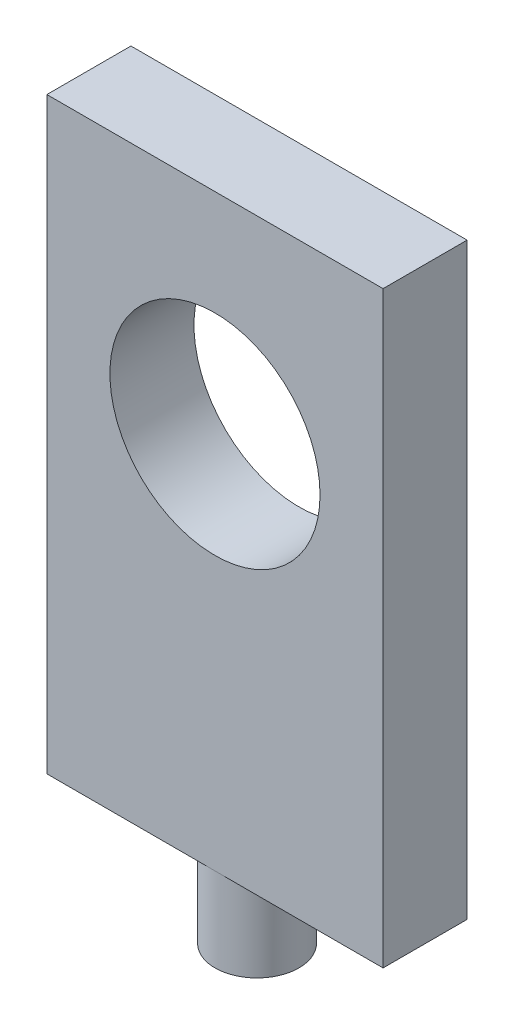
ISO-10303-21;
HEADER;
FILE_DESCRIPTION(('STEP AP214'),'2;1');
FILE_NAME('part.step','',(''),(''),'','','');
FILE_SCHEMA(('AUTOMOTIVE_DESIGN { 1 0 10303 214 1 1 1 1 }'));
ENDSEC;
DATA;
#1=APPLICATION_CONTEXT('core data for automotive mechanical design processes');
#2=APPLICATION_PROTOCOL_DEFINITION('international standard','automotive_design',2000,#1);
#3=PRODUCT_CONTEXT('',#1,'mechanical');
#4=PRODUCT('Part','Part','',(#3));
#5=PRODUCT_RELATED_PRODUCT_CATEGORY('part','',(#4));
#6=PRODUCT_DEFINITION_FORMATION('','',#4);
#7=PRODUCT_DEFINITION_CONTEXT('part definition',#1,'design');
#8=PRODUCT_DEFINITION('design','',#6,#7);
#9=PRODUCT_DEFINITION_SHAPE('','',#8);
#10=(LENGTH_UNIT() NAMED_UNIT(*) SI_UNIT(.MILLI.,.METRE.));
#11=(NAMED_UNIT(*) PLANE_ANGLE_UNIT() SI_UNIT($,.RADIAN.));
#12=(NAMED_UNIT(*) SI_UNIT($,.STERADIAN.) SOLID_ANGLE_UNIT());
#13=UNCERTAINTY_MEASURE_WITH_UNIT(LENGTH_MEASURE(1.E-05),#10,'distance_accuracy_value','');
#14=(GEOMETRIC_REPRESENTATION_CONTEXT(3) GLOBAL_UNCERTAINTY_ASSIGNED_CONTEXT((#13)) GLOBAL_UNIT_ASSIGNED_CONTEXT((#10,
#11,#12)) REPRESENTATION_CONTEXT('',''));
#15=CARTESIAN_POINT('',(0.,0.,0.));
#16=DIRECTION('',(0.,0.,1.));
#17=DIRECTION('',(1.,0.,0.));
#18=AXIS2_PLACEMENT_3D('',#15,#16,#17);
#19=CARTESIAN_POINT('',(0.,0.,10.));
#20=DIRECTION('',(0.,1.,0.));
#21=DIRECTION('',(0.,0.,1.));
#22=AXIS2_PLACEMENT_3D('',#19,#20,#21);
#23=PLANE('',#22);
#24=CARTESIAN_POINT('',(20.,0.,5.));
#25=DIRECTION('',(0.,-1.,0.));
#26=DIRECTION('',(0.,0.,-1.));
#27=AXIS2_PLACEMENT_3D('',#24,#25,#26);
#28=CIRCLE('',#27,5.);
#29=CARTESIAN_POINT('',(20.,0.,0.));
#30=VERTEX_POINT('',#29);
#31=CARTESIAN_POINT('',(20.,0.,10.));
#32=VERTEX_POINT('',#31);
#33=EDGE_CURVE('E45',#30,#32,#28,.T.);
#34=ORIENTED_EDGE('',*,*,#33,.F.);
#35=DIRECTION('',(1.,0.,0.));
#36=VECTOR('',#35,1.);
#37=CARTESIAN_POINT('',(0.,0.,0.));
#38=LINE('',#37,#36);
#39=CARTESIAN_POINT('',(40.,0.,0.));
#40=VERTEX_POINT('',#39);
#41=EDGE_CURVE('E96',#30,#40,#38,.T.);
#42=ORIENTED_EDGE('',*,*,#41,.T.);
#43=DIRECTION('',(0.,0.,-1.));
#44=VECTOR('',#43,1.);
#45=CARTESIAN_POINT('',(40.,0.,10.));
#46=LINE('',#45,#44);
#47=CARTESIAN_POINT('',(40.,0.,10.));
#48=VERTEX_POINT('',#47);
#49=EDGE_CURVE('E151',#48,#40,#46,.T.);
#50=ORIENTED_EDGE('',*,*,#49,.F.);
#51=DIRECTION('',(1.,0.,0.));
#52=VECTOR('',#51,1.);
#53=CARTESIAN_POINT('',(0.,0.,10.));
#54=LINE('',#53,#52);
#55=EDGE_CURVE('E106',#32,#48,#54,.T.);
#56=ORIENTED_EDGE('',*,*,#55,.F.);
#57=EDGE_LOOP('',(#34,#42,#50,#56));
#58=FACE_BOUND('',#57,.T.);
#59=ADVANCED_FACE('F35',(#58),#23,.F.);
#60=EDGE_CURVE('E11',#32,#30,#28,.T.);
#61=ORIENTED_EDGE('',*,*,#60,.F.);
#62=CARTESIAN_POINT('',(0.,0.,10.));
#63=VERTEX_POINT('',#62);
#64=EDGE_CURVE('E85',#63,#32,#54,.T.);
#65=ORIENTED_EDGE('',*,*,#64,.F.);
#66=DIRECTION('',(0.,0.,-1.));
#67=VECTOR('',#66,1.);
#68=CARTESIAN_POINT('',(0.,0.,10.));
#69=LINE('',#68,#67);
#70=CARTESIAN_POINT('',(0.,0.,0.));
#71=VERTEX_POINT('',#70);
#72=EDGE_CURVE('E39',#63,#71,#69,.T.);
#73=ORIENTED_EDGE('',*,*,#72,.T.);
#74=EDGE_CURVE('E88',#71,#30,#38,.T.);
#75=ORIENTED_EDGE('',*,*,#74,.T.);
#76=EDGE_LOOP('',(#61,#65,#73,#75));
#77=FACE_BOUND('',#76,.T.);
#78=ADVANCED_FACE('F90',(#77),#23,.F.);
#79=CARTESIAN_POINT('',(0.,0.,10.));
#80=DIRECTION('',(1.,0.,0.));
#81=DIRECTION('',(0.,0.,-1.));
#82=AXIS2_PLACEMENT_3D('',#79,#80,#81);
#83=PLANE('',#82);
#84=DIRECTION('',(0.,-1.,0.));
#85=VECTOR('',#84,1.);
#86=CARTESIAN_POINT('',(0.,0.,0.));
#87=LINE('',#86,#85);
#88=CARTESIAN_POINT('',(0.,70.,0.));
#89=VERTEX_POINT('',#88);
#90=EDGE_CURVE('E104',#89,#71,#87,.T.);
#91=ORIENTED_EDGE('',*,*,#90,.T.);
#92=ORIENTED_EDGE('',*,*,#72,.F.);
#93=DIRECTION('',(0.,-1.,0.));
#94=VECTOR('',#93,1.);
#95=CARTESIAN_POINT('',(0.,0.,10.));
#96=LINE('',#95,#94);
#97=CARTESIAN_POINT('',(0.,70.,10.));
#98=VERTEX_POINT('',#97);
#99=EDGE_CURVE('E148',#98,#63,#96,.T.);
#100=ORIENTED_EDGE('',*,*,#99,.F.);
#101=DIRECTION('',(0.,0.,-1.));
#102=VECTOR('',#101,1.);
#103=CARTESIAN_POINT('',(0.,70.,10.));
#104=LINE('',#103,#102);
#105=EDGE_CURVE('E154',#98,#89,#104,.T.);
#106=ORIENTED_EDGE('',*,*,#105,.T.);
#107=EDGE_LOOP('',(#91,#92,#100,#106));
#108=FACE_BOUND('',#107,.T.);
#109=ADVANCED_FACE('F37',(#108),#83,.F.);
#110=CARTESIAN_POINT('',(40.,0.,10.));
#111=DIRECTION('',(-1.,0.,0.));
#112=DIRECTION('',(0.,0.,1.));
#113=AXIS2_PLACEMENT_3D('',#110,#111,#112);
#114=PLANE('',#113);
#115=DIRECTION('',(0.,1.,0.));
#116=VECTOR('',#115,1.);
#117=CARTESIAN_POINT('',(40.,0.,0.));
#118=LINE('',#117,#116);
#119=CARTESIAN_POINT('',(40.,70.,0.));
#120=VERTEX_POINT('',#119);
#121=EDGE_CURVE('E95',#40,#120,#118,.T.);
#122=ORIENTED_EDGE('',*,*,#121,.T.);
#123=DIRECTION('',(0.,0.,-1.));
#124=VECTOR('',#123,1.);
#125=CARTESIAN_POINT('',(40.,70.,10.));
#126=LINE('',#125,#124);
#127=CARTESIAN_POINT('',(40.,70.,10.));
#128=VERTEX_POINT('',#127);
#129=EDGE_CURVE('E152',#128,#120,#126,.T.);
#130=ORIENTED_EDGE('',*,*,#129,.F.);
#131=DIRECTION('',(0.,1.,0.));
#132=VECTOR('',#131,1.);
#133=CARTESIAN_POINT('',(40.,0.,10.));
#134=LINE('',#133,#132);
#135=EDGE_CURVE('E163',#48,#128,#134,.T.);
#136=ORIENTED_EDGE('',*,*,#135,.F.);
#137=ORIENTED_EDGE('',*,*,#49,.T.);
#138=EDGE_LOOP('',(#122,#130,#136,#137));
#139=FACE_BOUND('',#138,.T.);
#140=ADVANCED_FACE('F129',(#139),#114,.F.);
#141=CARTESIAN_POINT('',(0.,70.,10.));
#142=DIRECTION('',(0.,-1.,0.));
#143=DIRECTION('',(0.,0.,-1.));
#144=AXIS2_PLACEMENT_3D('',#141,#142,#143);
#145=PLANE('',#144);
#146=DIRECTION('',(-1.,0.,0.));
#147=VECTOR('',#146,1.);
#148=CARTESIAN_POINT('',(0.,70.,0.));
#149=LINE('',#148,#147);
#150=EDGE_CURVE('E80',#120,#89,#149,.T.);
#151=ORIENTED_EDGE('',*,*,#150,.T.);
#152=ORIENTED_EDGE('',*,*,#105,.F.);
#153=DIRECTION('',(-1.,0.,0.));
#154=VECTOR('',#153,1.);
#155=CARTESIAN_POINT('',(0.,70.,10.));
#156=LINE('',#155,#154);
#157=EDGE_CURVE('E59',#128,#98,#156,.T.);
#158=ORIENTED_EDGE('',*,*,#157,.F.);
#159=ORIENTED_EDGE('',*,*,#129,.T.);
#160=EDGE_LOOP('',(#151,#152,#158,#159));
#161=FACE_BOUND('',#160,.T.);
#162=ADVANCED_FACE('F132',(#161),#145,.F.);
#163=CARTESIAN_POINT('',(0.,0.,10.));
#164=DIRECTION('',(0.,0.,-1.));
#165=DIRECTION('',(-1.,0.,0.));
#166=AXIS2_PLACEMENT_3D('',#163,#164,#165);
#167=PLANE('',#166);
#168=CARTESIAN_POINT('',(20.,45.,10.));
#169=DIRECTION('',(0.,0.,1.));
#170=DIRECTION('',(1.,0.,0.));
#171=AXIS2_PLACEMENT_3D('',#168,#169,#170);
#172=CIRCLE('',#171,12.5);
#173=CARTESIAN_POINT('',(32.5,45.,10.));
#174=VERTEX_POINT('',#173);
#175=EDGE_CURVE('E146',#174,#174,#172,.T.);
#176=ORIENTED_EDGE('',*,*,#175,.F.);
#177=EDGE_LOOP('',(#176));
#178=FACE_BOUND('',#177,.T.);
#179=ORIENTED_EDGE('',*,*,#99,.T.);
#180=ORIENTED_EDGE('',*,*,#64,.T.);
#181=ORIENTED_EDGE('',*,*,#55,.T.);
#182=ORIENTED_EDGE('',*,*,#135,.T.);
#183=ORIENTED_EDGE('',*,*,#157,.T.);
#184=EDGE_LOOP('',(#179,#180,#181,#182,#183));
#185=FACE_BOUND('',#184,.T.);
#186=ADVANCED_FACE('F136',(#178,#185),#167,.F.);
#187=CARTESIAN_POINT('',(0.,0.,0.));
#188=DIRECTION('',(0.,0.,-1.));
#189=DIRECTION('',(-1.,0.,0.));
#190=AXIS2_PLACEMENT_3D('',#187,#188,#189);
#191=PLANE('',#190);
#192=CARTESIAN_POINT('',(20.,45.,0.));
#193=DIRECTION('',(0.,0.,1.));
#194=DIRECTION('',(1.,0.,0.));
#195=AXIS2_PLACEMENT_3D('',#192,#193,#194);
#196=CIRCLE('',#195,12.5);
#197=CARTESIAN_POINT('',(32.5,45.,0.));
#198=VERTEX_POINT('',#197);
#199=EDGE_CURVE('E161',#198,#198,#196,.T.);
#200=ORIENTED_EDGE('',*,*,#199,.T.);
#201=EDGE_LOOP('',(#200));
#202=FACE_BOUND('',#201,.T.);
#203=ORIENTED_EDGE('',*,*,#90,.F.);
#204=ORIENTED_EDGE('',*,*,#150,.F.);
#205=ORIENTED_EDGE('',*,*,#121,.F.);
#206=ORIENTED_EDGE('',*,*,#41,.F.);
#207=ORIENTED_EDGE('',*,*,#74,.F.);
#208=EDGE_LOOP('',(#203,#204,#205,#206,#207));
#209=FACE_BOUND('',#208,.T.);
#210=ADVANCED_FACE('F100',(#202,#209),#191,.T.);
#211=CARTESIAN_POINT('',(20.,45.,0.));
#212=DIRECTION('',(0.,0.,1.));
#213=DIRECTION('',(1.,0.,0.));
#214=AXIS2_PLACEMENT_3D('',#211,#212,#213);
#215=CYLINDRICAL_SURFACE('',#214,12.5);
#216=ORIENTED_EDGE('',*,*,#199,.F.);
#217=EDGE_LOOP('',(#216));
#218=FACE_BOUND('',#217,.T.);
#219=ORIENTED_EDGE('',*,*,#175,.T.);
#220=EDGE_LOOP('',(#219));
#221=FACE_BOUND('',#220,.T.);
#222=ADVANCED_FACE('F112',(#218,#221),#215,.F.);
#223=CARTESIAN_POINT('',(20.,-10.,5.));
#224=DIRECTION('',(0.,1.,0.));
#225=DIRECTION('',(0.,0.,1.));
#226=AXIS2_PLACEMENT_3D('',#223,#224,#225);
#227=CYLINDRICAL_SURFACE('',#226,5.);
#228=CARTESIAN_POINT('',(20.,-10.,5.));
#229=DIRECTION('',(0.,-1.,0.));
#230=DIRECTION('',(0.,0.,-1.));
#231=AXIS2_PLACEMENT_3D('',#228,#229,#230);
#232=CIRCLE('',#231,5.);
#233=CARTESIAN_POINT('',(20.,-10.,0.));
#234=VERTEX_POINT('',#233);
#235=EDGE_CURVE('E108',#234,#234,#232,.T.);
#236=ORIENTED_EDGE('',*,*,#235,.F.);
#237=EDGE_LOOP('',(#236));
#238=FACE_BOUND('',#237,.T.);
#239=ORIENTED_EDGE('',*,*,#33,.T.);
#240=ORIENTED_EDGE('',*,*,#60,.T.);
#241=EDGE_LOOP('',(#239,#240));
#242=FACE_BOUND('',#241,.T.);
#243=ADVANCED_FACE('F109',(#238,#242),#227,.T.);
#244=CARTESIAN_POINT('',(20.,-10.,5.));
#245=DIRECTION('',(0.,-1.,0.));
#246=DIRECTION('',(0.,0.,-1.));
#247=AXIS2_PLACEMENT_3D('',#244,#245,#246);
#248=PLANE('',#247);
#249=ORIENTED_EDGE('',*,*,#235,.T.);
#250=EDGE_LOOP('',(#249));
#251=FACE_BOUND('',#250,.T.);
#252=ADVANCED_FACE('F111',(#251),#248,.T.);
#253=CLOSED_SHELL('',(#59,#78,#109,#140,#162,#186,#210,#222,#243,#252));
#254=MANIFOLD_SOLID_BREP('B2',#253);
#255=ADVANCED_BREP_SHAPE_REPRESENTATION('',(#18,#254),#14);
#256=SHAPE_DEFINITION_REPRESENTATION(#9,#255);
ENDSEC;
END-ISO-10303-21;
